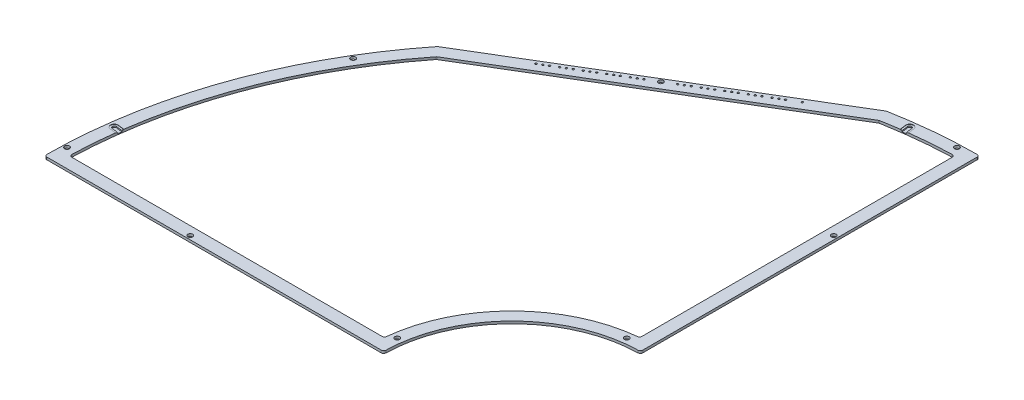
from build123d import *

# Parameters (mm, degrees)
EXTRUDE1_DEPTH  = 1.9812
SKETCH2_R       = 2
EXTRUDE4_DEPTH  = 539.818545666
SKETCH4_R       = 0.75
EXTRUDE5_DEPTH  = 539.818545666
EXTRUDE7_START  = -1.9812
EXTRUDE7_DEPTH  = 0.25
EXTRUDE10_DEPTH = 1
EXTRUDE8_START  = -1.9812
EXTRUDE8_DEPTH  = 0.25
EXTRUDE11_DEPTH = 1
FILLET2_R       = 2


with BuildPart() as part:
    # Sketch1 → Extrude1 (new body)
    with BuildSketch(Plane(origin=(0, 0, 0), x_dir=(1, 0, 0), z_dir=(0, 1, 0))):
        with BuildLine():
            Line((-69.791249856, 374.553309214), (-297.945935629, 237.464143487))
            ThreePointArc((-297.945935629, 237.464143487), (-359.554983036, 126.020689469), (-380.999671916, 0.5))
            Line((-380.999671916, 0.5), (-104.998809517, 0.5))
            ThreePointArc((-104.998809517, 0.5), (-74.246212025, 74.246212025), (-0.5, 104.998809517))
            Line((-0.5, 104.998809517), (-0.5, 380.999671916))
            ThreePointArc((-0.5, 380.999671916), (-35.293113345, 379.361827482), (-69.791249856, 374.553309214))
        make_face()
        with BuildLine():
            Line((-66.511116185, 364.857878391), (-290.925307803, 230.016228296))
            ThreePointArc((-290.925307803, 230.016228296), (-291.217572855, 229.802364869), (-291.466479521, 229.539302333))
            ThreePointArc((-291.466479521, 229.539302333), (-348.445267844, 127.384831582), (-370.78707049, 12.567750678))
            ThreePointArc((-370.78707049, 12.567750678), (-370.226185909, 11.109946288), (-368.788218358, 10.5))
            Line((-368.788218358, 10.5), (-116.330348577, 10.5))
            ThreePointArc((-116.330348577, 10.5), (-114.993813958, 11.012157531), (-114.34179561, 12.286324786))
            ThreePointArc((-114.34179561, 12.286324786), (-81.317279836, 81.317279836), (-12.286324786, 114.34179561))
            ThreePointArc((-12.286324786, 114.34179561), (-11.012157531, 114.993813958), (-10.5, 116.330348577))
            Line((-10.5, 116.330348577), (-10.5, 368.788218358))
            ThreePointArc((-10.5, 368.788218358), (-11.109946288, 370.226185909), (-12.567750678, 370.78707049))
            ThreePointArc((-12.567750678, 370.78707049), (-39.304417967, 368.912134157), (-65.835950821, 365.111801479))
            ThreePointArc((-65.835950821, 365.111801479), (-66.185075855, 365.015530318), (-66.511116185, 364.857878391))
        make_face(mode=Mode.SUBTRACT)
    extrude(amount=EXTRUDE1_DEPTH)

    # Sketch2 → Extrude4 (cut, through all)
    with BuildSketch(Plane(origin=(0, 0, 0), x_dir=(1, 0, 0), z_dir=(0, 1, 0))):
        with Locations(Location((-377.682075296, 15.5, 0), (0, 0, 270))):
            Circle(SKETCH2_R)
        with Locations(Location((-324.009239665, 194.684392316, 0), (0, 0, 270))):
            Circle(SKETCH2_R)
        with Locations(Location((-108.902479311, 15.5, 0), (0, 0, 270))):
            Circle(SKETCH2_R)
        with Locations(Location((-182.323478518, 303.437224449, 0), (0, 0, 270))):
            Circle(SKETCH2_R)
        with Locations(Location((-15.5, 108.902479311, 0), (0, 0, 270))):
            Circle(SKETCH2_R)
        with Locations(Location((-15.5, 377.682075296, 0), (0, 0, 270))):
            Circle(SKETCH2_R)
        with Locations(Location((-3.5, 265.406923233, 0), (0, 0, 270))):
            Circle(SKETCH2_R)
        with Locations(Location((-265.406923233, 3.5, 0), (0, 0, 270))):
            Circle(SKETCH2_R)
    extrude(amount=EXTRUDE4_DEPTH, mode=Mode.SUBTRACT)

    # Sketch4 → Extrude5 (cut, through all)
    with BuildSketch(Plane.XZ):
        with Locations(Location((-190.895151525, -298.286843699, 0), (0, 0, 270))):
            Circle(SKETCH4_R)
        with Locations(Location((-202.895493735, -291.076310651, 0), (0, 0, 270))):
            Circle(SKETCH4_R)
        with Locations(Location((-206.324162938, -289.016158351, 0), (0, 0, 270))):
            Circle(SKETCH4_R)
        with Locations(Location((-194.323820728, -296.2266914, 0), (0, 0, 270))):
            Circle(SKETCH4_R)
        with Locations(Location((-197.752489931, -294.1665391, 0), (0, 0, 270))):
            Circle(SKETCH4_R)
        with Locations(Location((-209.752832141, -286.956006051, 0), (0, 0, 270))):
            Circle(SKETCH4_R)
        with Locations(Location((-214.895835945, -283.865777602, 0), (0, 0, 270))):
            Circle(SKETCH4_R)
        with Locations(Location((-218.324505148, -281.805625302, 0), (0, 0, 270))):
            Circle(SKETCH4_R)
        with Locations(Location((-221.75317435, -279.745473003, 0), (0, 0, 270))):
            Circle(SKETCH4_R)
        with Locations(Location((-226.896178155, -276.655244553, 0), (0, 0, 270))):
            Circle(SKETCH4_R)
        with Locations(Location((-230.324847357, -274.595092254, 0), (0, 0, 270))):
            Circle(SKETCH4_R)
        with Locations(Location((-233.75351656, -272.534939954, 0), (0, 0, 270))):
            Circle(SKETCH4_R)
        with Locations(Location((-238.896520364, -269.444711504, 0), (0, 0, 270))):
            Circle(SKETCH4_R)
        with Locations(Location((-242.325189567, -267.384559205, 0), (0, 0, 270))):
            Circle(SKETCH4_R)
        with Locations(Location((-245.75385877, -265.324406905, 0), (0, 0, 270))):
            Circle(SKETCH4_R)
        with Locations(Location((-118.893098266, -341.550041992, 0), (0, 0, 90))):
            Circle(SKETCH4_R)
        with Locations(Location((-122.321767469, -339.489889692, 0), (0, 0, 90))):
            Circle(SKETCH4_R)
        with Locations(Location((-125.750436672, -337.429737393, 0), (0, 0, 90))):
            Circle(SKETCH4_R)
        with Locations(Location((-130.893440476, -334.339508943, 0), (0, 0, 90))):
            Circle(SKETCH4_R)
        with Locations(Location((-134.322109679, -332.279356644, 0), (0, 0, 90))):
            Circle(SKETCH4_R)
        with Locations(Location((-137.750778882, -330.219204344, 0), (0, 0, 90))):
            Circle(SKETCH4_R)
        with Locations(Location((-142.893782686, -327.128975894, 0), (0, 0, 90))):
            Circle(SKETCH4_R)
        with Locations(Location((-146.322451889, -325.068823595, 0), (0, 0, 90))):
            Circle(SKETCH4_R)
        with Locations(Location((-149.751121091, -323.008671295, 0), (0, 0, 90))):
            Circle(SKETCH4_R)
        with Locations(Location((-154.894124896, -319.918442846, 0), (0, 0, 90))):
            Circle(SKETCH4_R)
        with Locations(Location((-166.894467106, -312.707909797, 0), (0, 0, 90))):
            Circle(SKETCH4_R)
        with Locations(Location((-170.323136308, -310.647757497, 0), (0, 0, 90))):
            Circle(SKETCH4_R)
        with Locations(Location((-158.322794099, -317.858290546, 0), (0, 0, 90))):
            Circle(SKETCH4_R)
        with Locations(Location((-161.751463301, -315.798138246, 0), (0, 0, 90))):
            Circle(SKETCH4_R)
        with Locations(Location((-173.751805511, -308.587605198, 0), (0, 0, 90))):
            Circle(SKETCH4_R)
        with Locations(Location((-110.321425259, -346.700422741, 0), (0, 0, 270))):
            Circle(SKETCH4_R)
    extrude(amount=-EXTRUDE5_DEPTH, mode=Mode.SUBTRACT)

    # Sketch5 → Extrude7 (cut)
    with BuildSketch(Plane(origin=(-221.479687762, 0, -297.475625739), x_dir=(0.2756373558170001, 0, 0.9612616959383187), z_dir=(0, -1, 0)).offset(EXTRUDE7_START)):
        with BuildLine():
            Line((199.821530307, 215.1062898), (203.809020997, 205.935689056))
            Line((203.809020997, 205.935689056), (198.30666055, 203.543194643))
            Line((198.30666055, 203.543194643), (194.319169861, 212.713795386))
            ThreePointArc((194.319169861, 212.713795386), (195.874102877, 216.661222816), (199.821530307, 215.1062898))
        make_face()
    extrude(amount=EXTRUDE7_DEPTH, mode=Mode.SUBTRACT)

    # Sketch7 → Extrude10 (cut)
    with BuildSketch(Plane(origin=(0, 1.7312, 0), x_dir=(1, 0, 0), z_dir=(0, 1, 0))):
        with BuildLine():
            Line((-368.021554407, 46.847236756), (-367.606481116, 50.000031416))
            Line((-367.606481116, 50.000031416), (-372.575731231, 50.654245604))
            ThreePointArc((-372.575731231, 50.654245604), (-374.359665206, 49.28538492), (-372.990804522, 47.501450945))
            Line((-372.990804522, 47.501450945), (-368.021554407, 46.847236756))
        make_face()
    extrude(amount=-EXTRUDE10_DEPTH, mode=Mode.SUBTRACT)

    # Sketch5_7 → Extrude8 (cut)
    with BuildSketch(Plane(origin=(-221.479687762, 0, -297.475625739), x_dir=(0.2756373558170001, 0, 0.9612616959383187), z_dir=(0, -1, 0)).offset(EXTRUDE8_START)):
        with BuildLine():
            Line((-25.313392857, -183.51383637), (-15.423234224, -182.035742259))
            Line((-15.423234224, -182.035742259), (-14.536377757, -187.969837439))
            Line((-14.536377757, -187.969837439), (-24.426536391, -189.44793155))
            ThreePointArc((-24.426536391, -189.44793155), (-27.837012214, -186.924312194), (-25.313392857, -183.51383637))
        make_face()
    extrude(amount=EXTRUDE8_DEPTH, mode=Mode.SUBTRACT)

    # Sketch8 → Extrude11 (cut)
    with BuildSketch(Plane(origin=(0, 1.7312, 0), x_dir=(1, 0, 0), z_dir=(0, 1, 0))):
        with BuildLine():
            Line((-50.000031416, 367.606481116), (-46.847236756, 368.021554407))
            Line((-46.847236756, 368.021554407), (-47.501450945, 372.990804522))
            ThreePointArc((-47.501450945, 372.990804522), (-49.28538492, 374.359665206), (-50.654245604, 372.575731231))
            Line((-50.654245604, 372.575731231), (-50.000031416, 367.606481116))
        make_face()
    extrude(amount=-EXTRUDE11_DEPTH, mode=Mode.SUBTRACT)

    # Fillet2
    fillet2_edges = [part.edges().sort_by_distance(p)[0] for p in [
        (-0.5, 0.9906, -380.999671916),
        (-0.5, 0.9906, -104.998809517),
        (-104.998809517, 0.9906, -0.5),
        (-380.999671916, 0.9906, -0.5),
    ]]
    fillet(fillet2_edges, radius=FILLET2_R)


solid = part.part
